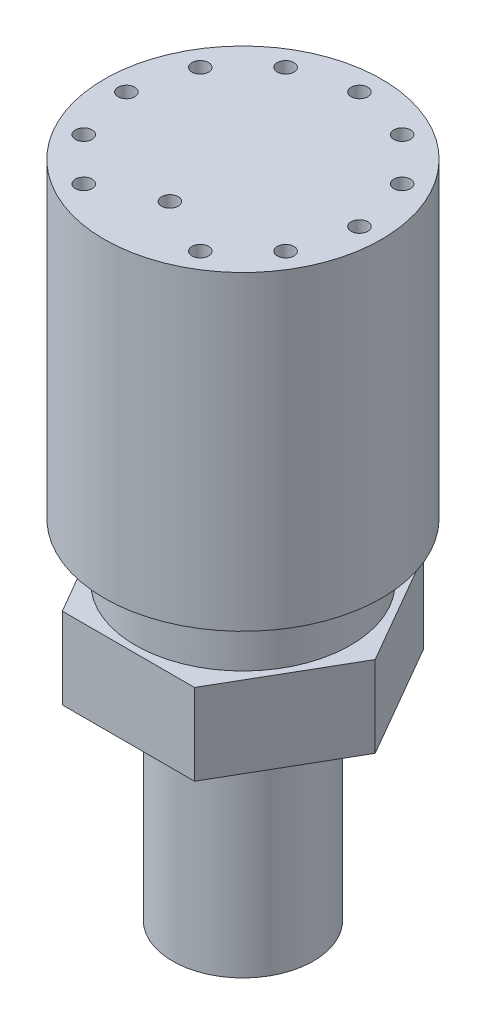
ISO-10303-21;
HEADER;
FILE_DESCRIPTION(('STEP AP214'),'2;1');
FILE_NAME('part.step','',(''),(''),'','','');
FILE_SCHEMA(('AUTOMOTIVE_DESIGN { 1 0 10303 214 1 1 1 1 }'));
ENDSEC;
DATA;
#1=APPLICATION_CONTEXT('core data for automotive mechanical design processes');
#2=APPLICATION_PROTOCOL_DEFINITION('international standard','automotive_design',2000,#1);
#3=PRODUCT_CONTEXT('',#1,'mechanical');
#4=PRODUCT('Part','Part','',(#3));
#5=PRODUCT_RELATED_PRODUCT_CATEGORY('part','',(#4));
#6=PRODUCT_DEFINITION_FORMATION('','',#4);
#7=PRODUCT_DEFINITION_CONTEXT('part definition',#1,'design');
#8=PRODUCT_DEFINITION('design','',#6,#7);
#9=PRODUCT_DEFINITION_SHAPE('','',#8);
#10=(LENGTH_UNIT() NAMED_UNIT(*) SI_UNIT(.MILLI.,.METRE.));
#11=(NAMED_UNIT(*) PLANE_ANGLE_UNIT() SI_UNIT($,.RADIAN.));
#12=(NAMED_UNIT(*) SI_UNIT($,.STERADIAN.) SOLID_ANGLE_UNIT());
#13=UNCERTAINTY_MEASURE_WITH_UNIT(LENGTH_MEASURE(1.E-05),#10,'distance_accuracy_value','');
#14=(GEOMETRIC_REPRESENTATION_CONTEXT(3) GLOBAL_UNCERTAINTY_ASSIGNED_CONTEXT((#13)) GLOBAL_UNIT_ASSIGNED_CONTEXT((#10,
#11,#12)) REPRESENTATION_CONTEXT('',''));
#15=CARTESIAN_POINT('',(0.,0.,0.));
#16=DIRECTION('',(0.,0.,1.));
#17=DIRECTION('',(1.,0.,0.));
#18=AXIS2_PLACEMENT_3D('',#15,#16,#17);
#19=CARTESIAN_POINT('',(5.95753309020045,0.,10.31875));
#20=DIRECTION('',(0.,-1.,0.));
#21=DIRECTION('',(0.,0.,-1.));
#22=AXIS2_PLACEMENT_3D('',#19,#20,#21);
#23=PLANE('',#22);
#24=CARTESIAN_POINT('',(0.,0.,0.));
#25=DIRECTION('',(0.,-1.,0.));
#26=DIRECTION('',(0.,0.,-1.));
#27=AXIS2_PLACEMENT_3D('',#24,#25,#26);
#28=CIRCLE('',#27,8.8154);
#29=CARTESIAN_POINT('',(0.,0.,-8.8154));
#30=VERTEX_POINT('',#29);
#31=EDGE_CURVE('E183',#30,#30,#28,.T.);
#32=ORIENTED_EDGE('',*,*,#31,.F.);
#33=EDGE_LOOP('',(#32));
#34=FACE_BOUND('',#33,.T.);
#35=DIRECTION('',(0.5,0.,-0.866025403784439));
#36=VECTOR('',#35,1.);
#37=CARTESIAN_POINT('',(5.95753309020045,0.,10.31875));
#38=LINE('',#37,#36);
#39=CARTESIAN_POINT('',(5.95753309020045,0.,10.31875));
#40=VERTEX_POINT('',#39);
#41=CARTESIAN_POINT('',(11.9150661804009,0.,0.));
#42=VERTEX_POINT('',#41);
#43=EDGE_CURVE('E125',#40,#42,#38,.T.);
#44=ORIENTED_EDGE('',*,*,#43,.F.);
#45=DIRECTION('',(1.,0.,0.));
#46=VECTOR('',#45,1.);
#47=CARTESIAN_POINT('',(-5.95753309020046,0.,10.31875));
#48=LINE('',#47,#46);
#49=CARTESIAN_POINT('',(-5.95753309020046,0.,10.31875));
#50=VERTEX_POINT('',#49);
#51=EDGE_CURVE('E84',#50,#40,#48,.T.);
#52=ORIENTED_EDGE('',*,*,#51,.F.);
#53=DIRECTION('',(0.5,0.,0.866025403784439));
#54=VECTOR('',#53,1.);
#55=CARTESIAN_POINT('',(-11.9150661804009,0.,0.));
#56=LINE('',#55,#54);
#57=CARTESIAN_POINT('',(-11.9150661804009,0.,0.));
#58=VERTEX_POINT('',#57);
#59=EDGE_CURVE('E78',#58,#50,#56,.T.);
#60=ORIENTED_EDGE('',*,*,#59,.F.);
#61=DIRECTION('',(-0.5,0.,0.866025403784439));
#62=VECTOR('',#61,1.);
#63=CARTESIAN_POINT('',(-5.95753309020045,0.,-10.31875));
#64=LINE('',#63,#62);
#65=CARTESIAN_POINT('',(-5.95753309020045,0.,-10.31875));
#66=VERTEX_POINT('',#65);
#67=EDGE_CURVE('E115',#66,#58,#64,.T.);
#68=ORIENTED_EDGE('',*,*,#67,.F.);
#69=DIRECTION('',(-1.,0.,0.));
#70=VECTOR('',#69,1.);
#71=CARTESIAN_POINT('',(5.95753309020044,0.,-10.31875));
#72=LINE('',#71,#70);
#73=CARTESIAN_POINT('',(5.95753309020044,0.,-10.31875));
#74=VERTEX_POINT('',#73);
#75=EDGE_CURVE('E131',#74,#66,#72,.T.);
#76=ORIENTED_EDGE('',*,*,#75,.F.);
#77=DIRECTION('',(-0.5,0.,-0.866025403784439));
#78=VECTOR('',#77,1.);
#79=CARTESIAN_POINT('',(11.9150661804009,0.,0.));
#80=LINE('',#79,#78);
#81=EDGE_CURVE('E128',#42,#74,#80,.T.);
#82=ORIENTED_EDGE('',*,*,#81,.F.);
#83=EDGE_LOOP('',(#44,#52,#60,#68,#76,#82));
#84=FACE_BOUND('',#83,.T.);
#85=ADVANCED_FACE('F38',(#34,#84),#23,.T.);
#86=CARTESIAN_POINT('',(5.95753309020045,7.32,10.31875));
#87=DIRECTION('',(0.,-1.,0.));
#88=DIRECTION('',(0.,0.,-1.));
#89=AXIS2_PLACEMENT_3D('',#86,#87,#88);
#90=PLANE('',#89);
#91=DIRECTION('',(0.5,0.,-0.866025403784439));
#92=VECTOR('',#91,1.);
#93=CARTESIAN_POINT('',(5.95753309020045,7.32,10.31875));
#94=LINE('',#93,#92);
#95=CARTESIAN_POINT('',(5.95753309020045,7.32,10.31875));
#96=VERTEX_POINT('',#95);
#97=CARTESIAN_POINT('',(11.9150661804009,7.32,0.));
#98=VERTEX_POINT('',#97);
#99=EDGE_CURVE('E136',#96,#98,#94,.T.);
#100=ORIENTED_EDGE('',*,*,#99,.T.);
#101=DIRECTION('',(-0.5,0.,-0.866025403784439));
#102=VECTOR('',#101,1.);
#103=CARTESIAN_POINT('',(11.9150661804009,7.32,0.));
#104=LINE('',#103,#102);
#105=CARTESIAN_POINT('',(5.95753309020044,7.32,-10.31875));
#106=VERTEX_POINT('',#105);
#107=EDGE_CURVE('E93',#98,#106,#104,.T.);
#108=ORIENTED_EDGE('',*,*,#107,.T.);
#109=DIRECTION('',(-1.,0.,0.));
#110=VECTOR('',#109,1.);
#111=CARTESIAN_POINT('',(5.95753309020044,7.32,-10.31875));
#112=LINE('',#111,#110);
#113=CARTESIAN_POINT('',(-5.95753309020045,7.32,-10.31875));
#114=VERTEX_POINT('',#113);
#115=EDGE_CURVE('E107',#106,#114,#112,.T.);
#116=ORIENTED_EDGE('',*,*,#115,.T.);
#117=DIRECTION('',(-0.5,0.,0.866025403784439));
#118=VECTOR('',#117,1.);
#119=CARTESIAN_POINT('',(-5.95753309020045,7.32,-10.31875));
#120=LINE('',#119,#118);
#121=CARTESIAN_POINT('',(-11.9150661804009,7.32,0.));
#122=VERTEX_POINT('',#121);
#123=EDGE_CURVE('E100',#114,#122,#120,.T.);
#124=ORIENTED_EDGE('',*,*,#123,.T.);
#125=DIRECTION('',(0.5,0.,0.866025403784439));
#126=VECTOR('',#125,1.);
#127=CARTESIAN_POINT('',(-11.9150661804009,7.32,0.));
#128=LINE('',#127,#126);
#129=CARTESIAN_POINT('',(-5.95753309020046,7.32,10.31875));
#130=VERTEX_POINT('',#129);
#131=EDGE_CURVE('E105',#122,#130,#128,.T.);
#132=ORIENTED_EDGE('',*,*,#131,.T.);
#133=DIRECTION('',(1.,0.,0.));
#134=VECTOR('',#133,1.);
#135=CARTESIAN_POINT('',(-5.95753309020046,7.32,10.31875));
#136=LINE('',#135,#134);
#137=EDGE_CURVE('E55',#130,#96,#136,.T.);
#138=ORIENTED_EDGE('',*,*,#137,.T.);
#139=EDGE_LOOP('',(#100,#108,#116,#124,#132,#138));
#140=FACE_BOUND('',#139,.T.);
#141=CARTESIAN_POINT('',(0.,7.32,0.));
#142=DIRECTION('',(0.,-1.,0.));
#143=DIRECTION('',(0.,0.,-1.));
#144=AXIS2_PLACEMENT_3D('',#141,#142,#143);
#145=CIRCLE('',#144,9.69521110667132);
#146=CARTESIAN_POINT('',(0.,7.32,-9.69521110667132));
#147=VERTEX_POINT('',#146);
#148=EDGE_CURVE('E12',#147,#147,#145,.F.);
#149=ORIENTED_EDGE('',*,*,#148,.F.);
#150=EDGE_LOOP('',(#149));
#151=FACE_BOUND('',#150,.T.);
#152=ADVANCED_FACE('F102',(#140,#151),#90,.F.);
#153=CARTESIAN_POINT('',(5.95753309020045,7.32,10.31875));
#154=DIRECTION('',(-0.866025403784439,0.,-0.5));
#155=DIRECTION('',(-0.5,0.,0.866025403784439));
#156=AXIS2_PLACEMENT_3D('',#153,#154,#155);
#157=PLANE('',#156);
#158=ORIENTED_EDGE('',*,*,#43,.T.);
#159=DIRECTION('',(0.,-1.,0.));
#160=VECTOR('',#159,1.);
#161=CARTESIAN_POINT('',(11.9150661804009,7.32,0.));
#162=LINE('',#161,#160);
#163=EDGE_CURVE('E47',#98,#42,#162,.T.);
#164=ORIENTED_EDGE('',*,*,#163,.F.);
#165=ORIENTED_EDGE('',*,*,#99,.F.);
#166=DIRECTION('',(0.,-1.,0.));
#167=VECTOR('',#166,1.);
#168=CARTESIAN_POINT('',(5.95753309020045,7.32,10.31875));
#169=LINE('',#168,#167);
#170=EDGE_CURVE('E121',#96,#40,#169,.T.);
#171=ORIENTED_EDGE('',*,*,#170,.T.);
#172=EDGE_LOOP('',(#158,#164,#165,#171));
#173=FACE_BOUND('',#172,.T.);
#174=ADVANCED_FACE('F40',(#173),#157,.F.);
#175=CARTESIAN_POINT('',(11.9150661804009,7.32,0.));
#176=DIRECTION('',(-0.866025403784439,0.,0.5));
#177=DIRECTION('',(0.5,0.,0.866025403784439));
#178=AXIS2_PLACEMENT_3D('',#175,#176,#177);
#179=PLANE('',#178);
#180=ORIENTED_EDGE('',*,*,#81,.T.);
#181=DIRECTION('',(0.,-1.,0.));
#182=VECTOR('',#181,1.);
#183=CARTESIAN_POINT('',(5.95753309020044,7.32,-10.31875));
#184=LINE('',#183,#182);
#185=EDGE_CURVE('E140',#106,#74,#184,.T.);
#186=ORIENTED_EDGE('',*,*,#185,.F.);
#187=ORIENTED_EDGE('',*,*,#107,.F.);
#188=ORIENTED_EDGE('',*,*,#163,.T.);
#189=EDGE_LOOP('',(#180,#186,#187,#188));
#190=FACE_BOUND('',#189,.T.);
#191=ADVANCED_FACE('F143',(#190),#179,.F.);
#192=CARTESIAN_POINT('',(5.95753309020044,7.32,-10.31875));
#193=DIRECTION('',(0.,0.,1.));
#194=DIRECTION('',(1.,0.,0.));
#195=AXIS2_PLACEMENT_3D('',#192,#193,#194);
#196=PLANE('',#195);
#197=ORIENTED_EDGE('',*,*,#75,.T.);
#198=DIRECTION('',(0.,-1.,0.));
#199=VECTOR('',#198,1.);
#200=CARTESIAN_POINT('',(-5.95753309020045,7.32,-10.31875));
#201=LINE('',#200,#199);
#202=EDGE_CURVE('E116',#114,#66,#201,.T.);
#203=ORIENTED_EDGE('',*,*,#202,.F.);
#204=ORIENTED_EDGE('',*,*,#115,.F.);
#205=ORIENTED_EDGE('',*,*,#185,.T.);
#206=EDGE_LOOP('',(#197,#203,#204,#205));
#207=FACE_BOUND('',#206,.T.);
#208=ADVANCED_FACE('F150',(#207),#196,.F.);
#209=CARTESIAN_POINT('',(-5.95753309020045,7.32,-10.31875));
#210=DIRECTION('',(0.866025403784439,0.,0.5));
#211=DIRECTION('',(0.5,0.,-0.866025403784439));
#212=AXIS2_PLACEMENT_3D('',#209,#210,#211);
#213=PLANE('',#212);
#214=ORIENTED_EDGE('',*,*,#67,.T.);
#215=DIRECTION('',(0.,-1.,0.));
#216=VECTOR('',#215,1.);
#217=CARTESIAN_POINT('',(-11.9150661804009,7.32,0.));
#218=LINE('',#217,#216);
#219=EDGE_CURVE('E112',#122,#58,#218,.T.);
#220=ORIENTED_EDGE('',*,*,#219,.F.);
#221=ORIENTED_EDGE('',*,*,#123,.F.);
#222=ORIENTED_EDGE('',*,*,#202,.T.);
#223=EDGE_LOOP('',(#214,#220,#221,#222));
#224=FACE_BOUND('',#223,.T.);
#225=ADVANCED_FACE('F113',(#224),#213,.F.);
#226=CARTESIAN_POINT('',(-11.9150661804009,7.32,0.));
#227=DIRECTION('',(0.866025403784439,0.,-0.5));
#228=DIRECTION('',(-0.5,0.,-0.866025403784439));
#229=AXIS2_PLACEMENT_3D('',#226,#227,#228);
#230=PLANE('',#229);
#231=ORIENTED_EDGE('',*,*,#59,.T.);
#232=DIRECTION('',(0.,-1.,0.));
#233=VECTOR('',#232,1.);
#234=CARTESIAN_POINT('',(-5.95753309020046,7.32,10.31875));
#235=LINE('',#234,#233);
#236=EDGE_CURVE('E117',#130,#50,#235,.T.);
#237=ORIENTED_EDGE('',*,*,#236,.F.);
#238=ORIENTED_EDGE('',*,*,#131,.F.);
#239=ORIENTED_EDGE('',*,*,#219,.T.);
#240=EDGE_LOOP('',(#231,#237,#238,#239));
#241=FACE_BOUND('',#240,.T.);
#242=ADVANCED_FACE('F119',(#241),#230,.F.);
#243=CARTESIAN_POINT('',(-5.95753309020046,7.32,10.31875));
#244=DIRECTION('',(0.,0.,-1.));
#245=DIRECTION('',(-1.,0.,0.));
#246=AXIS2_PLACEMENT_3D('',#243,#244,#245);
#247=PLANE('',#246);
#248=ORIENTED_EDGE('',*,*,#51,.T.);
#249=ORIENTED_EDGE('',*,*,#170,.F.);
#250=ORIENTED_EDGE('',*,*,#137,.F.);
#251=ORIENTED_EDGE('',*,*,#236,.T.);
#252=EDGE_LOOP('',(#248,#249,#250,#251));
#253=FACE_BOUND('',#252,.T.);
#254=ADVANCED_FACE('F313',(#253),#247,.F.);
#255=CARTESIAN_POINT('',(0.,12.4,0.));
#256=DIRECTION('',(0.,-1.,0.));
#257=DIRECTION('',(0.,0.,-1.));
#258=AXIS2_PLACEMENT_3D('',#255,#256,#257);
#259=CYLINDRICAL_SURFACE('',#258,9.69521110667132);
#260=CARTESIAN_POINT('',(0.,12.4,0.));
#261=DIRECTION('',(0.,1.,0.));
#262=DIRECTION('',(0.,0.,1.));
#263=AXIS2_PLACEMENT_3D('',#260,#261,#262);
#264=CIRCLE('',#263,9.69521110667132);
#265=CARTESIAN_POINT('',(0.,12.4,9.69521110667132));
#266=VERTEX_POINT('',#265);
#267=EDGE_CURVE('E129',#266,#266,#264,.T.);
#268=ORIENTED_EDGE('',*,*,#267,.F.);
#269=EDGE_LOOP('',(#268));
#270=FACE_BOUND('',#269,.T.);
#271=ORIENTED_EDGE('',*,*,#148,.T.);
#272=EDGE_LOOP('',(#271));
#273=FACE_BOUND('',#272,.T.);
#274=ADVANCED_FACE('F307',(#270,#273),#259,.T.);
#275=CARTESIAN_POINT('',(0.,12.4,0.));
#276=DIRECTION('',(0.,1.,0.));
#277=DIRECTION('',(0.,0.,1.));
#278=AXIS2_PLACEMENT_3D('',#275,#276,#277);
#279=PLANE('',#278);
#280=CARTESIAN_POINT('',(0.,12.4,0.));
#281=DIRECTION('',(0.,1.,0.));
#282=DIRECTION('',(0.,0.,1.));
#283=AXIS2_PLACEMENT_3D('',#280,#281,#282);
#284=CIRCLE('',#283,12.5);
#285=CARTESIAN_POINT('',(0.,12.4,12.5));
#286=VERTEX_POINT('',#285);
#287=EDGE_CURVE('E157',#286,#286,#284,.T.);
#288=ORIENTED_EDGE('',*,*,#287,.F.);
#289=EDGE_LOOP('',(#288));
#290=FACE_BOUND('',#289,.T.);
#291=ORIENTED_EDGE('',*,*,#267,.T.);
#292=EDGE_LOOP('',(#291));
#293=FACE_BOUND('',#292,.T.);
#294=ADVANCED_FACE('F301',(#290,#293),#279,.F.);
#295=CARTESIAN_POINT('',(0.,40.4,0.));
#296=DIRECTION('',(0.,-1.,0.));
#297=DIRECTION('',(0.,0.,-1.));
#298=AXIS2_PLACEMENT_3D('',#295,#296,#297);
#299=CYLINDRICAL_SURFACE('',#298,12.5);
#300=CARTESIAN_POINT('',(0.,40.4,0.));
#301=DIRECTION('',(0.,1.,0.));
#302=DIRECTION('',(0.,0.,1.));
#303=AXIS2_PLACEMENT_3D('',#300,#301,#302);
#304=CIRCLE('',#303,12.5);
#305=CARTESIAN_POINT('',(0.,40.4,12.5));
#306=VERTEX_POINT('',#305);
#307=EDGE_CURVE('E156',#306,#306,#304,.T.);
#308=ORIENTED_EDGE('',*,*,#307,.F.);
#309=EDGE_LOOP('',(#308));
#310=FACE_BOUND('',#309,.T.);
#311=ORIENTED_EDGE('',*,*,#287,.T.);
#312=EDGE_LOOP('',(#311));
#313=FACE_BOUND('',#312,.T.);
#314=ADVANCED_FACE('F273',(#310,#313),#299,.T.);
#315=CARTESIAN_POINT('',(0.,40.4,0.));
#316=DIRECTION('',(0.,1.,0.));
#317=DIRECTION('',(0.,0.,1.));
#318=AXIS2_PLACEMENT_3D('',#315,#316,#317);
#319=PLANE('',#318);
#320=CARTESIAN_POINT('',(0.,40.4,6.58207800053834));
#321=DIRECTION('',(0.,1.,0.));
#322=DIRECTION('',(0.,0.,1.));
#323=AXIS2_PLACEMENT_3D('',#320,#321,#322);
#324=CIRCLE('',#323,0.75);
#325=CARTESIAN_POINT('',(0.,40.4,7.33207800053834));
#326=VERTEX_POINT('',#325);
#327=EDGE_CURVE('E253',#326,#326,#324,.T.);
#328=ORIENTED_EDGE('',*,*,#327,.F.);
#329=EDGE_LOOP('',(#328));
#330=FACE_BOUND('',#329,.T.);
#331=CARTESIAN_POINT('',(-5.24999999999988,40.4,-9.09326673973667));
#332=DIRECTION('',(0.,1.,0.));
#333=DIRECTION('',(0.499999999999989,0.,0.866025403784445));
#334=AXIS2_PLACEMENT_3D('',#331,#332,#333);
#335=CIRCLE('',#334,0.75);
#336=CARTESIAN_POINT('',(-4.87499999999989,40.4,-8.44374768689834));
#337=VERTEX_POINT('',#336);
#338=EDGE_CURVE('E249',#337,#337,#335,.T.);
#339=ORIENTED_EDGE('',*,*,#338,.F.);
#340=EDGE_LOOP('',(#339));
#341=FACE_BOUND('',#340,.T.);
#342=CARTESIAN_POINT('',(-9.09326673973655,40.4,-5.25000000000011));
#343=DIRECTION('',(0.,1.,0.));
#344=DIRECTION('',(0.866025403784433,0.,0.50000000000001));
#345=AXIS2_PLACEMENT_3D('',#342,#343,#344);
#346=CIRCLE('',#345,0.75);
#347=CARTESIAN_POINT('',(-8.44374768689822,40.4,-4.8750000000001));
#348=VERTEX_POINT('',#347);
#349=EDGE_CURVE('E243',#348,#348,#346,.T.);
#350=ORIENTED_EDGE('',*,*,#349,.F.);
#351=EDGE_LOOP('',(#350));
#352=FACE_BOUND('',#351,.T.);
#353=CARTESIAN_POINT('',(-10.5,40.4,-1.09981725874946E-13));
#354=DIRECTION('',(0.,1.,0.));
#355=DIRECTION('',(1.,0.,0.));
#356=AXIS2_PLACEMENT_3D('',#353,#354,#355);
#357=CIRCLE('',#356,0.75);
#358=CARTESIAN_POINT('',(-9.75,40.4,-1.02125888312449E-13));
#359=VERTEX_POINT('',#358);
#360=EDGE_CURVE('E237',#359,#359,#357,.T.);
#361=ORIENTED_EDGE('',*,*,#360,.F.);
#362=EDGE_LOOP('',(#361));
#363=FACE_BOUND('',#362,.T.);
#364=CARTESIAN_POINT('',(-9.09326673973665,40.4,5.24999999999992));
#365=DIRECTION('',(0.,1.,0.));
#366=DIRECTION('',(0.866025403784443,0.,-0.499999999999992));
#367=AXIS2_PLACEMENT_3D('',#364,#365,#366);
#368=CIRCLE('',#367,0.75);
#369=CARTESIAN_POINT('',(-8.44374768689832,40.4,4.87499999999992));
#370=VERTEX_POINT('',#369);
#371=EDGE_CURVE('E231',#370,#370,#368,.T.);
#372=ORIENTED_EDGE('',*,*,#371,.F.);
#373=EDGE_LOOP('',(#372));
#374=FACE_BOUND('',#373,.T.);
#375=CARTESIAN_POINT('',(-5.25000000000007,40.4,9.09326673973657));
#376=DIRECTION('',(0.,1.,0.));
#377=DIRECTION('',(0.500000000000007,0.,-0.866025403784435));
#378=AXIS2_PLACEMENT_3D('',#375,#376,#377);
#379=CIRCLE('',#378,0.75);
#380=CARTESIAN_POINT('',(-4.87500000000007,40.4,8.44374768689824));
#381=VERTEX_POINT('',#380);
#382=EDGE_CURVE('E225',#381,#381,#379,.T.);
#383=ORIENTED_EDGE('',*,*,#382,.F.);
#384=EDGE_LOOP('',(#383));
#385=FACE_BOUND('',#384,.T.);
#386=CARTESIAN_POINT('',(5.24999999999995,40.4,9.09326673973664));
#387=DIRECTION('',(0.,1.,0.));
#388=DIRECTION('',(-0.499999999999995,0.,-0.866025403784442));
#389=AXIS2_PLACEMENT_3D('',#386,#387,#388);
#390=CIRCLE('',#389,0.75);
#391=CARTESIAN_POINT('',(4.87499999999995,40.4,8.44374768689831));
#392=VERTEX_POINT('',#391);
#393=EDGE_CURVE('E219',#392,#392,#390,.T.);
#394=ORIENTED_EDGE('',*,*,#393,.F.);
#395=EDGE_LOOP('',(#394));
#396=FACE_BOUND('',#395,.T.);
#397=CARTESIAN_POINT('',(9.09326673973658,40.4,5.25000000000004));
#398=DIRECTION('',(0.,1.,0.));
#399=DIRECTION('',(-0.866025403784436,0.,-0.500000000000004));
#400=AXIS2_PLACEMENT_3D('',#397,#398,#399);
#401=CIRCLE('',#400,0.75);
#402=CARTESIAN_POINT('',(8.44374768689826,40.4,4.87500000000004));
#403=VERTEX_POINT('',#402);
#404=EDGE_CURVE('E213',#403,#403,#401,.T.);
#405=ORIENTED_EDGE('',*,*,#404,.F.);
#406=EDGE_LOOP('',(#405));
#407=FACE_BOUND('',#406,.T.);
#408=CARTESIAN_POINT('',(10.5,40.4,0.));
#409=DIRECTION('',(0.,1.,0.));
#410=DIRECTION('',(-1.,0.,0.));
#411=AXIS2_PLACEMENT_3D('',#408,#409,#410);
#412=CIRCLE('',#411,0.75);
#413=CARTESIAN_POINT('',(9.75,40.4,0.));
#414=VERTEX_POINT('',#413);
#415=EDGE_CURVE('E207',#414,#414,#412,.T.);
#416=ORIENTED_EDGE('',*,*,#415,.F.);
#417=EDGE_LOOP('',(#416));
#418=FACE_BOUND('',#417,.T.);
#419=CARTESIAN_POINT('',(9.09326673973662,40.4,-5.24999999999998));
#420=DIRECTION('',(0.,1.,0.));
#421=DIRECTION('',(-0.86602540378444,0.,0.499999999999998));
#422=AXIS2_PLACEMENT_3D('',#419,#420,#421);
#423=CIRCLE('',#422,0.75);
#424=CARTESIAN_POINT('',(8.44374768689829,40.4,-4.87499999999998));
#425=VERTEX_POINT('',#424);
#426=EDGE_CURVE('E201',#425,#425,#423,.T.);
#427=ORIENTED_EDGE('',*,*,#426,.F.);
#428=EDGE_LOOP('',(#427));
#429=FACE_BOUND('',#428,.T.);
#430=CARTESIAN_POINT('',(5.25000000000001,40.4,-9.0932667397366));
#431=DIRECTION('',(0.,1.,0.));
#432=DIRECTION('',(-0.500000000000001,0.,0.866025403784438));
#433=AXIS2_PLACEMENT_3D('',#430,#431,#432);
#434=CIRCLE('',#433,0.75);
#435=CARTESIAN_POINT('',(4.87500000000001,40.4,-8.44374768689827));
#436=VERTEX_POINT('',#435);
#437=EDGE_CURVE('E195',#436,#436,#434,.T.);
#438=ORIENTED_EDGE('',*,*,#437,.F.);
#439=EDGE_LOOP('',(#438));
#440=FACE_BOUND('',#439,.T.);
#441=CARTESIAN_POINT('',(0.,40.4,-10.5));
#442=DIRECTION('',(0.,1.,0.));
#443=DIRECTION('',(0.,0.,1.));
#444=AXIS2_PLACEMENT_3D('',#441,#442,#443);
#445=CIRCLE('',#444,0.75);
#446=CARTESIAN_POINT('',(0.,40.4,-9.75));
#447=VERTEX_POINT('',#446);
#448=EDGE_CURVE('E187',#447,#447,#445,.T.);
#449=ORIENTED_EDGE('',*,*,#448,.F.);
#450=EDGE_LOOP('',(#449));
#451=FACE_BOUND('',#450,.T.);
#452=ORIENTED_EDGE('',*,*,#307,.T.);
#453=EDGE_LOOP('',(#452));
#454=FACE_BOUND('',#453,.T.);
#455=ADVANCED_FACE('F269',(#330,#341,#352,#363,#374,#385,#396,#407,#418,#429,#440,#451,#454),
#319,.T.);
#456=CARTESIAN_POINT('',(0.,0.,0.));
#457=DIRECTION('',(0.,-1.,0.));
#458=DIRECTION('',(0.,0.,-1.));
#459=AXIS2_PLACEMENT_3D('',#456,#457,#458);
#460=CYLINDRICAL_SURFACE('',#459,6.25);
#461=CARTESIAN_POINT('',(0.,0.,0.));
#462=DIRECTION('',(0.,-1.,0.));
#463=DIRECTION('',(0.,0.,-1.));
#464=AXIS2_PLACEMENT_3D('',#461,#462,#463);
#465=CIRCLE('',#464,6.25);
#466=CARTESIAN_POINT('',(0.,0.,-6.25));
#467=VERTEX_POINT('',#466);
#468=EDGE_CURVE('E174',#467,#467,#465,.T.);
#469=ORIENTED_EDGE('',*,*,#468,.F.);
#470=EDGE_LOOP('',(#469));
#471=FACE_BOUND('',#470,.T.);
#472=CARTESIAN_POINT('',(0.,1.27,0.));
#473=DIRECTION('',(0.,-1.,0.));
#474=DIRECTION('',(0.,0.,-1.));
#475=AXIS2_PLACEMENT_3D('',#472,#473,#474);
#476=CIRCLE('',#475,6.25);
#477=CARTESIAN_POINT('',(0.,1.27,-6.25));
#478=VERTEX_POINT('',#477);
#479=EDGE_CURVE('E177',#478,#478,#476,.T.);
#480=ORIENTED_EDGE('',*,*,#479,.T.);
#481=EDGE_LOOP('',(#480));
#482=FACE_BOUND('',#481,.T.);
#483=ADVANCED_FACE('F272',(#471,#482),#460,.T.);
#484=CARTESIAN_POINT('',(6.25,1.27,0.));
#485=DIRECTION('',(0.,1.,0.));
#486=DIRECTION('',(0.,0.,1.));
#487=AXIS2_PLACEMENT_3D('',#484,#485,#486);
#488=PLANE('',#487);
#489=ORIENTED_EDGE('',*,*,#479,.F.);
#490=EDGE_LOOP('',(#489));
#491=FACE_BOUND('',#490,.T.);
#492=CARTESIAN_POINT('',(0.,1.27,0.));
#493=DIRECTION('',(0.,-1.,0.));
#494=DIRECTION('',(0.,0.,-1.));
#495=AXIS2_PLACEMENT_3D('',#492,#493,#494);
#496=CIRCLE('',#495,8.8154);
#497=CARTESIAN_POINT('',(0.,1.27,-8.8154));
#498=VERTEX_POINT('',#497);
#499=EDGE_CURVE('E180',#498,#498,#496,.T.);
#500=ORIENTED_EDGE('',*,*,#499,.T.);
#501=EDGE_LOOP('',(#500));
#502=FACE_BOUND('',#501,.T.);
#503=ADVANCED_FACE('F380',(#491,#502),#488,.F.);
#504=CARTESIAN_POINT('',(0.,0.,0.));
#505=DIRECTION('',(0.,-1.,0.));
#506=DIRECTION('',(0.,0.,-1.));
#507=AXIS2_PLACEMENT_3D('',#504,#505,#506);
#508=CYLINDRICAL_SURFACE('',#507,8.8154);
#509=ORIENTED_EDGE('',*,*,#499,.F.);
#510=EDGE_LOOP('',(#509));
#511=FACE_BOUND('',#510,.T.);
#512=ORIENTED_EDGE('',*,*,#31,.T.);
#513=EDGE_LOOP('',(#512));
#514=FACE_BOUND('',#513,.T.);
#515=ADVANCED_FACE('F389',(#511,#514),#508,.F.);
#516=CARTESIAN_POINT('',(5.95753309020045,-19.,10.31875));
#517=DIRECTION('',(0.,-1.,0.));
#518=DIRECTION('',(0.,0.,-1.));
#519=AXIS2_PLACEMENT_3D('',#516,#517,#518);
#520=PLANE('',#519);
#521=CARTESIAN_POINT('',(0.,-19.,0.));
#522=DIRECTION('',(0.,-1.,0.));
#523=DIRECTION('',(0.,0.,-1.));
#524=AXIS2_PLACEMENT_3D('',#521,#522,#523);
#525=CIRCLE('',#524,6.35);
#526=CARTESIAN_POINT('',(0.,-19.,-6.35));
#527=VERTEX_POINT('',#526);
#528=EDGE_CURVE('E166',#527,#527,#525,.T.);
#529=ORIENTED_EDGE('',*,*,#528,.T.);
#530=EDGE_LOOP('',(#529));
#531=FACE_BOUND('',#530,.T.);
#532=ADVANCED_FACE('F397',(#531),#520,.T.);
#533=CARTESIAN_POINT('',(0.,-55.9605122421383,0.));
#534=DIRECTION('',(0.,1.,0.));
#535=DIRECTION('',(0.,0.,1.));
#536=AXIS2_PLACEMENT_3D('',#533,#534,#535);
#537=CYLINDRICAL_SURFACE('',#536,6.35);
#538=CARTESIAN_POINT('',(0.,-2.8194,0.));
#539=DIRECTION('',(0.,-1.,0.));
#540=DIRECTION('',(0.,0.,-1.));
#541=AXIS2_PLACEMENT_3D('',#538,#539,#540);
#542=CIRCLE('',#541,6.35);
#543=CARTESIAN_POINT('',(0.,-2.8194,-6.35));
#544=VERTEX_POINT('',#543);
#545=EDGE_CURVE('E171',#544,#544,#542,.T.);
#546=ORIENTED_EDGE('',*,*,#545,.T.);
#547=EDGE_LOOP('',(#546));
#548=FACE_BOUND('',#547,.T.);
#549=ORIENTED_EDGE('',*,*,#528,.F.);
#550=EDGE_LOOP('',(#549));
#551=FACE_BOUND('',#550,.T.);
#552=ADVANCED_FACE('F406',(#548,#551),#537,.T.);
#553=CARTESIAN_POINT('',(0.,-2.8194,0.));
#554=DIRECTION('',(0.,-1.,0.));
#555=DIRECTION('',(0.,0.,-1.));
#556=AXIS2_PLACEMENT_3D('',#553,#554,#555);
#557=PLANE('',#556);
#558=ORIENTED_EDGE('',*,*,#545,.F.);
#559=EDGE_LOOP('',(#558));
#560=FACE_BOUND('',#559,.T.);
#561=CARTESIAN_POINT('',(0.,-2.8194,0.));
#562=DIRECTION('',(0.,-1.,0.));
#563=DIRECTION('',(0.,0.,-1.));
#564=AXIS2_PLACEMENT_3D('',#561,#562,#563);
#565=CIRCLE('',#564,5.5);
#566=CARTESIAN_POINT('',(0.,-2.8194,-5.5));
#567=VERTEX_POINT('',#566);
#568=EDGE_CURVE('E160',#567,#567,#565,.T.);
#569=ORIENTED_EDGE('',*,*,#568,.T.);
#570=EDGE_LOOP('',(#569));
#571=FACE_BOUND('',#570,.T.);
#572=ADVANCED_FACE('F415',(#560,#571),#557,.F.);
#573=CARTESIAN_POINT('',(0.,-2.8194,0.));
#574=DIRECTION('',(0.,1.,0.));
#575=DIRECTION('',(0.,0.,1.));
#576=AXIS2_PLACEMENT_3D('',#573,#574,#575);
#577=CYLINDRICAL_SURFACE('',#576,5.5);
#578=ORIENTED_EDGE('',*,*,#568,.F.);
#579=EDGE_LOOP('',(#578));
#580=FACE_BOUND('',#579,.T.);
#581=CARTESIAN_POINT('',(0.,0.,0.));
#582=DIRECTION('',(0.,-1.,0.));
#583=DIRECTION('',(0.,0.,-1.));
#584=AXIS2_PLACEMENT_3D('',#581,#582,#583);
#585=CIRCLE('',#584,5.5);
#586=CARTESIAN_POINT('',(0.,0.,-5.5));
#587=VERTEX_POINT('',#586);
#588=EDGE_CURVE('E163',#587,#587,#585,.T.);
#589=ORIENTED_EDGE('',*,*,#588,.T.);
#590=EDGE_LOOP('',(#589));
#591=FACE_BOUND('',#590,.T.);
#592=ADVANCED_FACE('F423',(#580,#591),#577,.T.);
#593=ORIENTED_EDGE('',*,*,#468,.T.);
#594=EDGE_LOOP('',(#593));
#595=FACE_BOUND('',#594,.T.);
#596=ORIENTED_EDGE('',*,*,#588,.F.);
#597=EDGE_LOOP('',(#596));
#598=FACE_BOUND('',#597,.T.);
#599=ADVANCED_FACE('F324',(#595,#598),#23,.T.);
#600=CARTESIAN_POINT('',(0.,28.4,-10.5));
#601=DIRECTION('',(0.,1.,0.));
#602=DIRECTION('',(0.,0.,1.));
#603=AXIS2_PLACEMENT_3D('',#600,#601,#602);
#604=CYLINDRICAL_SURFACE('',#603,0.75);
#605=CARTESIAN_POINT('',(0.,28.4,-10.5));
#606=DIRECTION('',(0.,1.,0.));
#607=DIRECTION('',(0.,0.,1.));
#608=AXIS2_PLACEMENT_3D('',#605,#606,#607);
#609=CIRCLE('',#608,0.75);
#610=CARTESIAN_POINT('',(0.,28.4,-9.75));
#611=VERTEX_POINT('',#610);
#612=EDGE_CURVE('E186',#611,#611,#609,.T.);
#613=ORIENTED_EDGE('',*,*,#612,.F.);
#614=EDGE_LOOP('',(#613));
#615=FACE_BOUND('',#614,.T.);
#616=ORIENTED_EDGE('',*,*,#448,.T.);
#617=EDGE_LOOP('',(#616));
#618=FACE_BOUND('',#617,.T.);
#619=ADVANCED_FACE('F436',(#615,#618),#604,.F.);
#620=CARTESIAN_POINT('',(0.,28.4,-10.5));
#621=DIRECTION('',(0.,1.,0.));
#622=DIRECTION('',(0.,0.,1.));
#623=AXIS2_PLACEMENT_3D('',#620,#621,#622);
#624=PLANE('',#623);
#625=ORIENTED_EDGE('',*,*,#612,.T.);
#626=EDGE_LOOP('',(#625));
#627=FACE_BOUND('',#626,.T.);
#628=ADVANCED_FACE('F443',(#627),#624,.T.);
#629=CARTESIAN_POINT('',(5.25000000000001,28.4,-9.0932667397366));
#630=DIRECTION('',(0.,1.,0.));
#631=DIRECTION('',(-0.500000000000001,0.,0.866025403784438));
#632=AXIS2_PLACEMENT_3D('',#629,#630,#631);
#633=CYLINDRICAL_SURFACE('',#632,0.75);
#634=CARTESIAN_POINT('',(5.25000000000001,28.4,-9.0932667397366));
#635=DIRECTION('',(0.,1.,0.));
#636=DIRECTION('',(-0.500000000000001,0.,0.866025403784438));
#637=AXIS2_PLACEMENT_3D('',#634,#635,#636);
#638=CIRCLE('',#637,0.75);
#639=CARTESIAN_POINT('',(4.87500000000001,28.4,-8.44374768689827));
#640=VERTEX_POINT('',#639);
#641=EDGE_CURVE('E190',#640,#640,#638,.T.);
#642=ORIENTED_EDGE('',*,*,#641,.F.);
#643=EDGE_LOOP('',(#642));
#644=FACE_BOUND('',#643,.T.);
#645=ORIENTED_EDGE('',*,*,#437,.T.);
#646=EDGE_LOOP('',(#645));
#647=FACE_BOUND('',#646,.T.);
#648=ADVANCED_FACE('F451',(#644,#647),#633,.F.);
#649=CARTESIAN_POINT('',(5.25000000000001,28.4,-9.0932667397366));
#650=DIRECTION('',(0.,1.,0.));
#651=DIRECTION('',(-0.500000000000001,0.,0.866025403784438));
#652=AXIS2_PLACEMENT_3D('',#649,#650,#651);
#653=PLANE('',#652);
#654=ORIENTED_EDGE('',*,*,#641,.T.);
#655=EDGE_LOOP('',(#654));
#656=FACE_BOUND('',#655,.T.);
#657=ADVANCED_FACE('F454',(#656),#653,.T.);
#658=CARTESIAN_POINT('',(9.09326673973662,28.4,-5.24999999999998));
#659=DIRECTION('',(0.,1.,0.));
#660=DIRECTION('',(-0.86602540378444,0.,0.499999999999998));
#661=AXIS2_PLACEMENT_3D('',#658,#659,#660);
#662=CYLINDRICAL_SURFACE('',#661,0.75);
#663=CARTESIAN_POINT('',(9.09326673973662,28.4,-5.24999999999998));
#664=DIRECTION('',(0.,1.,0.));
#665=DIRECTION('',(-0.86602540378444,0.,0.499999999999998));
#666=AXIS2_PLACEMENT_3D('',#663,#664,#665);
#667=CIRCLE('',#666,0.75);
#668=CARTESIAN_POINT('',(8.44374768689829,28.4,-4.87499999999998));
#669=VERTEX_POINT('',#668);
#670=EDGE_CURVE('E198',#669,#669,#667,.T.);
#671=ORIENTED_EDGE('',*,*,#670,.F.);
#672=EDGE_LOOP('',(#671));
#673=FACE_BOUND('',#672,.T.);
#674=ORIENTED_EDGE('',*,*,#426,.T.);
#675=EDGE_LOOP('',(#674));
#676=FACE_BOUND('',#675,.T.);
#677=ADVANCED_FACE('F469',(#673,#676),#662,.F.);
#678=CARTESIAN_POINT('',(9.09326673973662,28.4,-5.24999999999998));
#679=DIRECTION('',(0.,1.,0.));
#680=DIRECTION('',(-0.86602540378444,0.,0.499999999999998));
#681=AXIS2_PLACEMENT_3D('',#678,#679,#680);
#682=PLANE('',#681);
#683=ORIENTED_EDGE('',*,*,#670,.T.);
#684=EDGE_LOOP('',(#683));
#685=FACE_BOUND('',#684,.T.);
#686=ADVANCED_FACE('F463',(#685),#682,.T.);
#687=CARTESIAN_POINT('',(10.5,28.4,0.));
#688=DIRECTION('',(0.,1.,0.));
#689=DIRECTION('',(-1.,0.,0.));
#690=AXIS2_PLACEMENT_3D('',#687,#688,#689);
#691=CYLINDRICAL_SURFACE('',#690,0.75);
#692=CARTESIAN_POINT('',(10.5,28.4,0.));
#693=DIRECTION('',(0.,1.,0.));
#694=DIRECTION('',(-1.,0.,0.));
#695=AXIS2_PLACEMENT_3D('',#692,#693,#694);
#696=CIRCLE('',#695,0.75);
#697=CARTESIAN_POINT('',(9.75,28.4,0.));
#698=VERTEX_POINT('',#697);
#699=EDGE_CURVE('E204',#698,#698,#696,.T.);
#700=ORIENTED_EDGE('',*,*,#699,.F.);
#701=EDGE_LOOP('',(#700));
#702=FACE_BOUND('',#701,.T.);
#703=ORIENTED_EDGE('',*,*,#415,.T.);
#704=EDGE_LOOP('',(#703));
#705=FACE_BOUND('',#704,.T.);
#706=ADVANCED_FACE('F485',(#702,#705),#691,.F.);
#707=CARTESIAN_POINT('',(10.5,28.4,0.));
#708=DIRECTION('',(0.,1.,0.));
#709=DIRECTION('',(-1.,0.,0.));
#710=AXIS2_PLACEMENT_3D('',#707,#708,#709);
#711=PLANE('',#710);
#712=ORIENTED_EDGE('',*,*,#699,.T.);
#713=EDGE_LOOP('',(#712));
#714=FACE_BOUND('',#713,.T.);
#715=ADVANCED_FACE('F479',(#714),#711,.T.);
#716=CARTESIAN_POINT('',(9.09326673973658,28.4,5.25000000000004));
#717=DIRECTION('',(0.,1.,0.));
#718=DIRECTION('',(-0.866025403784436,0.,-0.500000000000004));
#719=AXIS2_PLACEMENT_3D('',#716,#717,#718);
#720=CYLINDRICAL_SURFACE('',#719,0.75);
#721=CARTESIAN_POINT('',(9.09326673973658,28.4,5.25000000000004));
#722=DIRECTION('',(0.,1.,0.));
#723=DIRECTION('',(-0.866025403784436,0.,-0.500000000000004));
#724=AXIS2_PLACEMENT_3D('',#721,#722,#723);
#725=CIRCLE('',#724,0.75);
#726=CARTESIAN_POINT('',(8.44374768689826,28.4,4.87500000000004));
#727=VERTEX_POINT('',#726);
#728=EDGE_CURVE('E210',#727,#727,#725,.T.);
#729=ORIENTED_EDGE('',*,*,#728,.F.);
#730=EDGE_LOOP('',(#729));
#731=FACE_BOUND('',#730,.T.);
#732=ORIENTED_EDGE('',*,*,#404,.T.);
#733=EDGE_LOOP('',(#732));
#734=FACE_BOUND('',#733,.T.);
#735=ADVANCED_FACE('F501',(#731,#734),#720,.F.);
#736=CARTESIAN_POINT('',(9.09326673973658,28.4,5.25000000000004));
#737=DIRECTION('',(0.,1.,0.));
#738=DIRECTION('',(-0.866025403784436,0.,-0.500000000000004));
#739=AXIS2_PLACEMENT_3D('',#736,#737,#738);
#740=PLANE('',#739);
#741=ORIENTED_EDGE('',*,*,#728,.T.);
#742=EDGE_LOOP('',(#741));
#743=FACE_BOUND('',#742,.T.);
#744=ADVANCED_FACE('F495',(#743),#740,.T.);
#745=CARTESIAN_POINT('',(5.24999999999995,28.4,9.09326673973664));
#746=DIRECTION('',(0.,1.,0.));
#747=DIRECTION('',(-0.499999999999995,0.,-0.866025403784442));
#748=AXIS2_PLACEMENT_3D('',#745,#746,#747);
#749=CYLINDRICAL_SURFACE('',#748,0.75);
#750=CARTESIAN_POINT('',(5.24999999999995,28.4,9.09326673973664));
#751=DIRECTION('',(0.,1.,0.));
#752=DIRECTION('',(-0.499999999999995,0.,-0.866025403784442));
#753=AXIS2_PLACEMENT_3D('',#750,#751,#752);
#754=CIRCLE('',#753,0.75);
#755=CARTESIAN_POINT('',(4.87499999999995,28.4,8.44374768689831));
#756=VERTEX_POINT('',#755);
#757=EDGE_CURVE('E216',#756,#756,#754,.T.);
#758=ORIENTED_EDGE('',*,*,#757,.F.);
#759=EDGE_LOOP('',(#758));
#760=FACE_BOUND('',#759,.T.);
#761=ORIENTED_EDGE('',*,*,#393,.T.);
#762=EDGE_LOOP('',(#761));
#763=FACE_BOUND('',#762,.T.);
#764=ADVANCED_FACE('F517',(#760,#763),#749,.F.);
#765=CARTESIAN_POINT('',(5.24999999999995,28.4,9.09326673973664));
#766=DIRECTION('',(0.,1.,0.));
#767=DIRECTION('',(-0.499999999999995,0.,-0.866025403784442));
#768=AXIS2_PLACEMENT_3D('',#765,#766,#767);
#769=PLANE('',#768);
#770=ORIENTED_EDGE('',*,*,#757,.T.);
#771=EDGE_LOOP('',(#770));
#772=FACE_BOUND('',#771,.T.);
#773=ADVANCED_FACE('F511',(#772),#769,.T.);
#774=CARTESIAN_POINT('',(-5.25000000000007,28.4,9.09326673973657));
#775=DIRECTION('',(0.,1.,0.));
#776=DIRECTION('',(0.500000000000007,0.,-0.866025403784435));
#777=AXIS2_PLACEMENT_3D('',#774,#775,#776);
#778=CYLINDRICAL_SURFACE('',#777,0.75);
#779=CARTESIAN_POINT('',(-5.25000000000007,28.4,9.09326673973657));
#780=DIRECTION('',(0.,1.,0.));
#781=DIRECTION('',(0.500000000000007,0.,-0.866025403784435));
#782=AXIS2_PLACEMENT_3D('',#779,#780,#781);
#783=CIRCLE('',#782,0.75);
#784=CARTESIAN_POINT('',(-4.87500000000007,28.4,8.44374768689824));
#785=VERTEX_POINT('',#784);
#786=EDGE_CURVE('E222',#785,#785,#783,.T.);
#787=ORIENTED_EDGE('',*,*,#786,.F.);
#788=EDGE_LOOP('',(#787));
#789=FACE_BOUND('',#788,.T.);
#790=ORIENTED_EDGE('',*,*,#382,.T.);
#791=EDGE_LOOP('',(#790));
#792=FACE_BOUND('',#791,.T.);
#793=ADVANCED_FACE('F533',(#789,#792),#778,.F.);
#794=CARTESIAN_POINT('',(-5.25000000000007,28.4,9.09326673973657));
#795=DIRECTION('',(0.,1.,0.));
#796=DIRECTION('',(0.500000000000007,0.,-0.866025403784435));
#797=AXIS2_PLACEMENT_3D('',#794,#795,#796);
#798=PLANE('',#797);
#799=ORIENTED_EDGE('',*,*,#786,.T.);
#800=EDGE_LOOP('',(#799));
#801=FACE_BOUND('',#800,.T.);
#802=ADVANCED_FACE('F527',(#801),#798,.T.);
#803=CARTESIAN_POINT('',(-9.09326673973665,28.4,5.24999999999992));
#804=DIRECTION('',(0.,1.,0.));
#805=DIRECTION('',(0.866025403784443,0.,-0.499999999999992));
#806=AXIS2_PLACEMENT_3D('',#803,#804,#805);
#807=CYLINDRICAL_SURFACE('',#806,0.75);
#808=CARTESIAN_POINT('',(-9.09326673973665,28.4,5.24999999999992));
#809=DIRECTION('',(0.,1.,0.));
#810=DIRECTION('',(0.866025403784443,0.,-0.499999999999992));
#811=AXIS2_PLACEMENT_3D('',#808,#809,#810);
#812=CIRCLE('',#811,0.75);
#813=CARTESIAN_POINT('',(-8.44374768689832,28.4,4.87499999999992));
#814=VERTEX_POINT('',#813);
#815=EDGE_CURVE('E228',#814,#814,#812,.T.);
#816=ORIENTED_EDGE('',*,*,#815,.F.);
#817=EDGE_LOOP('',(#816));
#818=FACE_BOUND('',#817,.T.);
#819=ORIENTED_EDGE('',*,*,#371,.T.);
#820=EDGE_LOOP('',(#819));
#821=FACE_BOUND('',#820,.T.);
#822=ADVANCED_FACE('F549',(#818,#821),#807,.F.);
#823=CARTESIAN_POINT('',(-9.09326673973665,28.4,5.24999999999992));
#824=DIRECTION('',(0.,1.,0.));
#825=DIRECTION('',(0.866025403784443,0.,-0.499999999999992));
#826=AXIS2_PLACEMENT_3D('',#823,#824,#825);
#827=PLANE('',#826);
#828=ORIENTED_EDGE('',*,*,#815,.T.);
#829=EDGE_LOOP('',(#828));
#830=FACE_BOUND('',#829,.T.);
#831=ADVANCED_FACE('F543',(#830),#827,.T.);
#832=CARTESIAN_POINT('',(-10.5,28.4,-1.09981725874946E-13));
#833=DIRECTION('',(0.,1.,0.));
#834=DIRECTION('',(1.,0.,0.));
#835=AXIS2_PLACEMENT_3D('',#832,#833,#834);
#836=CYLINDRICAL_SURFACE('',#835,0.75);
#837=CARTESIAN_POINT('',(-10.5,28.4,-1.09981725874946E-13));
#838=DIRECTION('',(0.,1.,0.));
#839=DIRECTION('',(1.,0.,0.));
#840=AXIS2_PLACEMENT_3D('',#837,#838,#839);
#841=CIRCLE('',#840,0.75);
#842=CARTESIAN_POINT('',(-9.75,28.4,-1.02125888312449E-13));
#843=VERTEX_POINT('',#842);
#844=EDGE_CURVE('E234',#843,#843,#841,.T.);
#845=ORIENTED_EDGE('',*,*,#844,.F.);
#846=EDGE_LOOP('',(#845));
#847=FACE_BOUND('',#846,.T.);
#848=ORIENTED_EDGE('',*,*,#360,.T.);
#849=EDGE_LOOP('',(#848));
#850=FACE_BOUND('',#849,.T.);
#851=ADVANCED_FACE('F565',(#847,#850),#836,.F.);
#852=CARTESIAN_POINT('',(-10.5,28.4,-1.09981725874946E-13));
#853=DIRECTION('',(0.,1.,0.));
#854=DIRECTION('',(1.,0.,0.));
#855=AXIS2_PLACEMENT_3D('',#852,#853,#854);
#856=PLANE('',#855);
#857=ORIENTED_EDGE('',*,*,#844,.T.);
#858=EDGE_LOOP('',(#857));
#859=FACE_BOUND('',#858,.T.);
#860=ADVANCED_FACE('F559',(#859),#856,.T.);
#861=CARTESIAN_POINT('',(-9.09326673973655,28.4,-5.25000000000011));
#862=DIRECTION('',(0.,1.,0.));
#863=DIRECTION('',(0.866025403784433,0.,0.50000000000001));
#864=AXIS2_PLACEMENT_3D('',#861,#862,#863);
#865=CYLINDRICAL_SURFACE('',#864,0.75);
#866=CARTESIAN_POINT('',(-9.09326673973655,28.4,-5.25000000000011));
#867=DIRECTION('',(0.,1.,0.));
#868=DIRECTION('',(0.866025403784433,0.,0.50000000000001));
#869=AXIS2_PLACEMENT_3D('',#866,#867,#868);
#870=CIRCLE('',#869,0.75);
#871=CARTESIAN_POINT('',(-8.44374768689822,28.4,-4.8750000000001));
#872=VERTEX_POINT('',#871);
#873=EDGE_CURVE('E240',#872,#872,#870,.T.);
#874=ORIENTED_EDGE('',*,*,#873,.F.);
#875=EDGE_LOOP('',(#874));
#876=FACE_BOUND('',#875,.T.);
#877=ORIENTED_EDGE('',*,*,#349,.T.);
#878=EDGE_LOOP('',(#877));
#879=FACE_BOUND('',#878,.T.);
#880=ADVANCED_FACE('F581',(#876,#879),#865,.F.);
#881=CARTESIAN_POINT('',(-9.09326673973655,28.4,-5.25000000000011));
#882=DIRECTION('',(0.,1.,0.));
#883=DIRECTION('',(0.866025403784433,0.,0.50000000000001));
#884=AXIS2_PLACEMENT_3D('',#881,#882,#883);
#885=PLANE('',#884);
#886=ORIENTED_EDGE('',*,*,#873,.T.);
#887=EDGE_LOOP('',(#886));
#888=FACE_BOUND('',#887,.T.);
#889=ADVANCED_FACE('F575',(#888),#885,.T.);
#890=CARTESIAN_POINT('',(-5.24999999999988,28.4,-9.09326673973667));
#891=DIRECTION('',(0.,1.,0.));
#892=DIRECTION('',(0.499999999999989,0.,0.866025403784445));
#893=AXIS2_PLACEMENT_3D('',#890,#891,#892);
#894=CYLINDRICAL_SURFACE('',#893,0.75);
#895=CARTESIAN_POINT('',(-5.24999999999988,28.4,-9.09326673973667));
#896=DIRECTION('',(0.,1.,0.));
#897=DIRECTION('',(0.499999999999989,0.,0.866025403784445));
#898=AXIS2_PLACEMENT_3D('',#895,#896,#897);
#899=CIRCLE('',#898,0.75);
#900=CARTESIAN_POINT('',(-4.87499999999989,28.4,-8.44374768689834));
#901=VERTEX_POINT('',#900);
#902=EDGE_CURVE('E246',#901,#901,#899,.T.);
#903=ORIENTED_EDGE('',*,*,#902,.F.);
#904=EDGE_LOOP('',(#903));
#905=FACE_BOUND('',#904,.T.);
#906=ORIENTED_EDGE('',*,*,#338,.T.);
#907=EDGE_LOOP('',(#906));
#908=FACE_BOUND('',#907,.T.);
#909=ADVANCED_FACE('F266',(#905,#908),#894,.F.);
#910=CARTESIAN_POINT('',(-5.24999999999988,28.4,-9.09326673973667));
#911=DIRECTION('',(0.,1.,0.));
#912=DIRECTION('',(0.499999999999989,0.,0.866025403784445));
#913=AXIS2_PLACEMENT_3D('',#910,#911,#912);
#914=PLANE('',#913);
#915=ORIENTED_EDGE('',*,*,#902,.T.);
#916=EDGE_LOOP('',(#915));
#917=FACE_BOUND('',#916,.T.);
#918=ADVANCED_FACE('F264',(#917),#914,.T.);
#919=CARTESIAN_POINT('',(0.,28.4,6.58207800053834));
#920=DIRECTION('',(0.,1.,0.));
#921=DIRECTION('',(0.,0.,1.));
#922=AXIS2_PLACEMENT_3D('',#919,#920,#921);
#923=CYLINDRICAL_SURFACE('',#922,0.75);
#924=CARTESIAN_POINT('',(0.,28.4,6.58207800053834));
#925=DIRECTION('',(0.,1.,0.));
#926=DIRECTION('',(0.,0.,1.));
#927=AXIS2_PLACEMENT_3D('',#924,#925,#926);
#928=CIRCLE('',#927,0.75);
#929=CARTESIAN_POINT('',(0.,28.4,7.33207800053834));
#930=VERTEX_POINT('',#929);
#931=EDGE_CURVE('E252',#930,#930,#928,.T.);
#932=ORIENTED_EDGE('',*,*,#931,.F.);
#933=EDGE_LOOP('',(#932));
#934=FACE_BOUND('',#933,.T.);
#935=ORIENTED_EDGE('',*,*,#327,.T.);
#936=EDGE_LOOP('',(#935));
#937=FACE_BOUND('',#936,.T.);
#938=ADVANCED_FACE('F261',(#934,#937),#923,.F.);
#939=CARTESIAN_POINT('',(0.,28.4,6.58207800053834));
#940=DIRECTION('',(0.,1.,0.));
#941=DIRECTION('',(0.,0.,1.));
#942=AXIS2_PLACEMENT_3D('',#939,#940,#941);
#943=PLANE('',#942);
#944=ORIENTED_EDGE('',*,*,#931,.T.);
#945=EDGE_LOOP('',(#944));
#946=FACE_BOUND('',#945,.T.);
#947=ADVANCED_FACE('F259',(#946),#943,.T.);
#948=CLOSED_SHELL('',(#85,#152,#174,#191,#208,#225,#242,#254,#274,#294,#314,#455,#483,#503,#515,
#532,#552,#572,#592,#599,#619,#628,#648,#657,#677,#686,#706,#715,#735,#744,#764,#773,#793,#802,
#822,#831,#851,#860,#880,#889,#909,#918,#938,#947));
#949=MANIFOLD_SOLID_BREP('B2',#948);
#950=ADVANCED_BREP_SHAPE_REPRESENTATION('',(#18,#949),#14);
#951=SHAPE_DEFINITION_REPRESENTATION(#9,#950);
ENDSEC;
END-ISO-10303-21;
